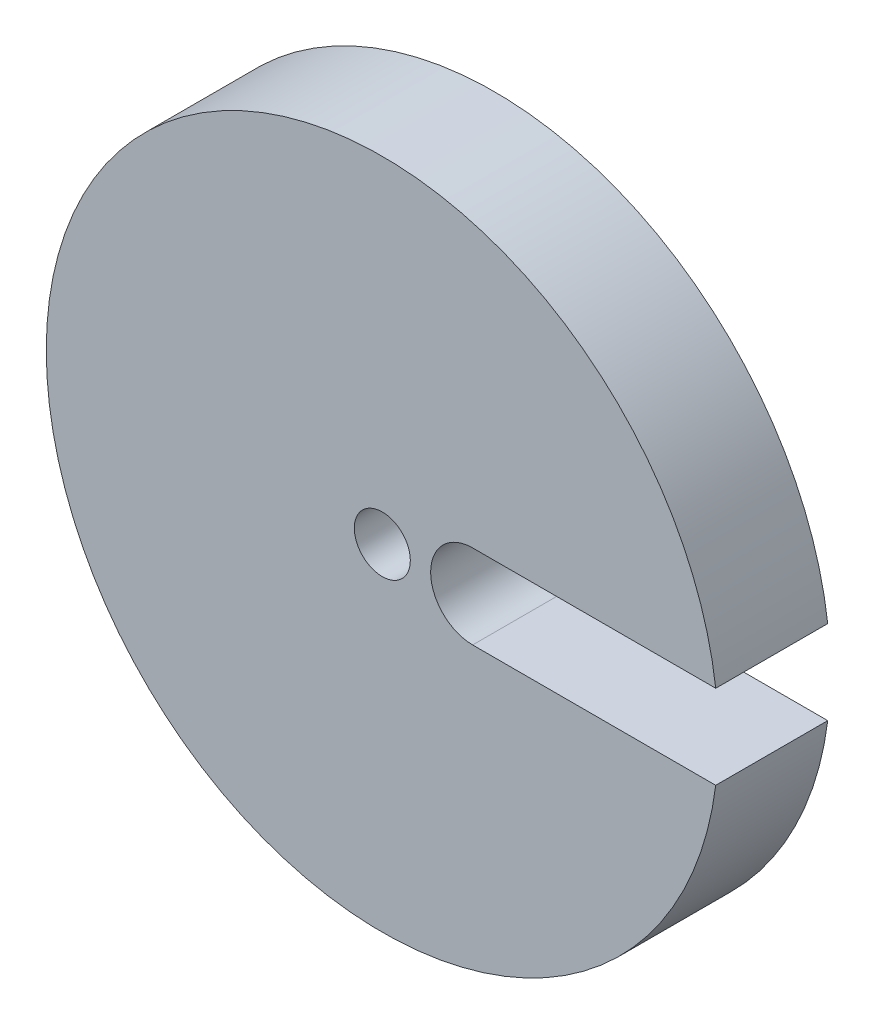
from build123d import *

# Parameters (mm, degrees)
CROQUIS1_R            = 60
EXTRUIR1_DEPTH        = 20
CROQUIS2_R            = 5
CORTAR_EXTRUIR1_DEPTH = 20
CORTAR_EXTRUIR2_DEPTH = 20


with BuildPart() as part:
    # Croquis1 → Extruir1 (new body)
    with BuildSketch(Plane.XY):
        Circle(CROQUIS1_R)
    extrude(amount=EXTRUIR1_DEPTH)

    # Croquis2 → Cortar-Extruir1 (cut)
    with BuildSketch(Plane.XY.offset(20)):
        Circle(CROQUIS2_R)
    extrude(amount=-CORTAR_EXTRUIR1_DEPTH, mode=Mode.SUBTRACT)

    # Croquis3 → Cortar-Extruir2 (cut)
    with BuildSketch(Plane.XY.offset(20)):
        with BuildLine():
            Line((16.128752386, 7.5), (59.529404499, 7.5))
            Line((59.529404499, 7.5), (72.489453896, 7.5))
            Line((72.489453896, 7.5), (72.489453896, -7.5))
            Line((72.489453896, -7.5), (59.529404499, -7.5))
            Line((59.529404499, -7.5), (16.128752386, -7.5))
            ThreePointArc((16.128752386, -7.5), (8.628752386, 0), (16.128752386, 7.5))
        make_face()
    extrude(amount=-CORTAR_EXTRUIR2_DEPTH, mode=Mode.SUBTRACT)


solid = part.part
